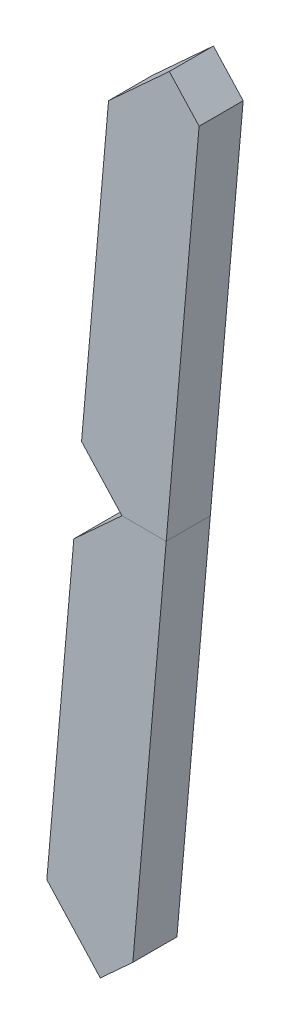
from build123d import *

# Parameters (mm, degrees)
AUFSATZ_LIN_UN_START    = -0.5
AUFSATZ_LIN_UN_DEPTH    = 0.5
AUFSATZ_LIN_LI_START    = -0.5
AUFSATZ_LIN_LI_UN_DEPTH = 0.5
AUFSATZ_LIN_RE_START    = -0.5
AUFSATZ_LIN_RE_UN_DEPTH = 0.5
AUFSATZ_LIN_MI_START    = -0.5
AUFSATZ_LIN_MI_DEPTH    = 0.5
KREISMUSTER_OB_COUNT    = 2


with BuildPart() as part:
    # Un → Aufsatz-Lin_Un (new body)
    with BuildSketch(Plane.XY.offset(AUFSATZ_LIN_UN_START)):
        Polygon((-2.451169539, -5), (1.638205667, -5), (2.006844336, -4.662204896), (1.400045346, -4), (-2.099954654, -4), (-2.788964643, -4.631361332), align=None)
    extrude(amount=AUFSATZ_LIN_UN_DEPTH)


with BuildPart() as body_2:
    # Li un → Aufsatz-Lin_Li un (new body)
    with BuildSketch(Plane.XY.offset(AUFSATZ_LIN_LI_START)):
        Polygon((-3.126759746, -4.262722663), (-2.753819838, 0), (-2.251909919, 0), (-1.793744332, -0.5), (-2.099954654, -4), (-2.788964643, -4.631361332), align=None)
    extrude(amount=AUFSATZ_LIN_LI_UN_DEPTH)


with BuildPart() as body_3:
    # Re un → Aufsatz-Lin_Re un (new body)
    with BuildSketch(Plane.XY.offset(AUFSATZ_LIN_RE_START)):
        Polygon((1.400045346, -4), (1.706255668, -0.5), (2.251909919, 0), (2.753819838, 0), (2.375483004, -4.324409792), (2.006844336, -4.662204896), align=None)
    extrude(amount=AUFSATZ_LIN_RE_UN_DEPTH)


with BuildPart() as body_4:
    # Mi → Aufsatz-Lin_Mi (new body)
    with BuildSketch(Plane.XY.offset(AUFSATZ_LIN_MI_START)):
        Polygon((-1.793744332, -0.5), (1.706255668, -0.5), (2.251909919, 0), (1.793744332, 0.5), (-1.706255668, 0.5), (-2.251909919, 0), align=None)
    extrude(amount=AUFSATZ_LIN_MI_DEPTH)


with BuildPart() as kreismuster_ob_1:
    # Kreismuster_Ob: pattern copy
    add(body_3.part.rotate(Axis((0, 0, 0), (0, 0, 1)), 1 * 360 / KREISMUSTER_OB_COUNT))


with BuildPart() as kreismuster_ob_2:
    # Kreismuster_Ob: pattern copy
    add(body_2.part.rotate(Axis((0, 0, 0), (0, 0, 1)), 1 * 360 / KREISMUSTER_OB_COUNT))


with BuildPart() as kreismuster_ob_3:
    # Kreismuster_Ob: pattern copy
    add(part.part.rotate(Axis((0, 0, 0), (0, 0, 1)), 1 * 360 / KREISMUSTER_OB_COUNT))


solid = Compound([body_3.part, kreismuster_ob_2.part])
